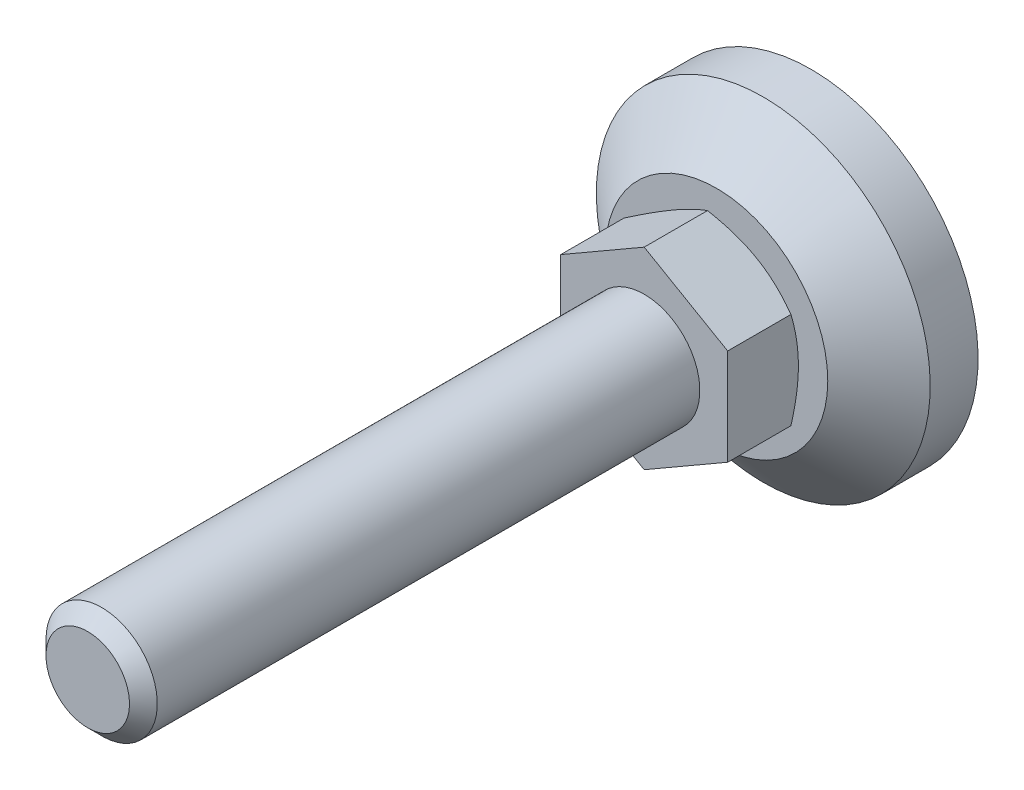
ISO-10303-21;
HEADER;
FILE_DESCRIPTION(('STEP AP214'),'2;1');
FILE_NAME('part.step','',(''),(''),'','','');
FILE_SCHEMA(('AUTOMOTIVE_DESIGN { 1 0 10303 214 1 1 1 1 }'));
ENDSEC;
DATA;
#1=APPLICATION_CONTEXT('core data for automotive mechanical design processes');
#2=APPLICATION_PROTOCOL_DEFINITION('international standard','automotive_design',2000,#1);
#3=PRODUCT_CONTEXT('',#1,'mechanical');
#4=PRODUCT('Part','Part','',(#3));
#5=PRODUCT_RELATED_PRODUCT_CATEGORY('part','',(#4));
#6=PRODUCT_DEFINITION_FORMATION('','',#4);
#7=PRODUCT_DEFINITION_CONTEXT('part definition',#1,'design');
#8=PRODUCT_DEFINITION('design','',#6,#7);
#9=PRODUCT_DEFINITION_SHAPE('','',#8);
#10=(LENGTH_UNIT() NAMED_UNIT(*) SI_UNIT(.MILLI.,.METRE.));
#11=(NAMED_UNIT(*) PLANE_ANGLE_UNIT() SI_UNIT($,.RADIAN.));
#12=(NAMED_UNIT(*) SI_UNIT($,.STERADIAN.) SOLID_ANGLE_UNIT());
#13=UNCERTAINTY_MEASURE_WITH_UNIT(LENGTH_MEASURE(1.E-05),#10,'distance_accuracy_value','');
#14=(GEOMETRIC_REPRESENTATION_CONTEXT(3) GLOBAL_UNCERTAINTY_ASSIGNED_CONTEXT((#13)) GLOBAL_UNIT_ASSIGNED_CONTEXT((#10,
#11,#12)) REPRESENTATION_CONTEXT('',''));
#15=CARTESIAN_POINT('',(0.,0.,0.));
#16=DIRECTION('',(0.,0.,1.));
#17=DIRECTION('',(1.,0.,0.));
#18=AXIS2_PLACEMENT_3D('',#15,#16,#17);
#19=CARTESIAN_POINT('',(0.,0.,30.));
#20=DIRECTION('',(0.,0.,1.));
#21=DIRECTION('',(0.5,-0.86602540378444,0.));
#22=AXIS2_PLACEMENT_3D('',#19,#20,#21);
#23=PLANE('',#22);
#24=DIRECTION('',(0.,1.,0.));
#25=VECTOR('',#24,1.);
#26=CARTESIAN_POINT('',(15.,-8.66025403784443,30.));
#27=LINE('',#26,#25);
#28=CARTESIAN_POINT('',(15.,-8.66025403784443,30.));
#29=VERTEX_POINT('',#28);
#30=CARTESIAN_POINT('',(15.,8.66025403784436,30.));
#31=VERTEX_POINT('',#30);
#32=EDGE_CURVE('E197',#29,#31,#27,.T.);
#33=ORIENTED_EDGE('',*,*,#32,.T.);
#34=DIRECTION('',(-0.866025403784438,0.5,0.));
#35=VECTOR('',#34,1.);
#36=CARTESIAN_POINT('',(15.,8.66025403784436,30.));
#37=LINE('',#36,#35);
#38=CARTESIAN_POINT('',(0.,17.3205080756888,30.));
#39=VERTEX_POINT('',#38);
#40=EDGE_CURVE('E320',#31,#39,#37,.T.);
#41=ORIENTED_EDGE('',*,*,#40,.T.);
#42=DIRECTION('',(-0.86602540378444,-0.5,0.));
#43=VECTOR('',#42,1.);
#44=CARTESIAN_POINT('',(0.,17.3205080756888,30.));
#45=LINE('',#44,#43);
#46=CARTESIAN_POINT('',(-15.,8.66025403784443,30.));
#47=VERTEX_POINT('',#46);
#48=EDGE_CURVE('E319',#39,#47,#45,.T.);
#49=ORIENTED_EDGE('',*,*,#48,.T.);
#50=DIRECTION('',(0.,-1.,0.));
#51=VECTOR('',#50,1.);
#52=CARTESIAN_POINT('',(-15.,8.66025403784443,30.));
#53=LINE('',#52,#51);
#54=CARTESIAN_POINT('',(-15.,-8.66025403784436,30.));
#55=VERTEX_POINT('',#54);
#56=EDGE_CURVE('E324',#47,#55,#53,.T.);
#57=ORIENTED_EDGE('',*,*,#56,.T.);
#58=DIRECTION('',(0.866025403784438,-0.5,0.));
#59=VECTOR('',#58,1.);
#60=CARTESIAN_POINT('',(-15.,-8.66025403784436,30.));
#61=LINE('',#60,#59);
#62=CARTESIAN_POINT('',(0.,-17.3205080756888,30.));
#63=VERTEX_POINT('',#62);
#64=EDGE_CURVE('E326',#55,#63,#61,.T.);
#65=ORIENTED_EDGE('',*,*,#64,.T.);
#66=DIRECTION('',(0.86602540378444,0.5,0.));
#67=VECTOR('',#66,1.);
#68=CARTESIAN_POINT('',(0.,-17.3205080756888,30.));
#69=LINE('',#68,#67);
#70=EDGE_CURVE('E37',#63,#29,#69,.T.);
#71=ORIENTED_EDGE('',*,*,#70,.T.);
#72=EDGE_LOOP('',(#33,#41,#49,#57,#65,#71));
#73=FACE_BOUND('',#72,.T.);
#74=CARTESIAN_POINT('',(0.,0.,30.));
#75=DIRECTION('',(0.,0.,1.));
#76=DIRECTION('',(0.5,-0.86602540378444,0.));
#77=AXIS2_PLACEMENT_3D('',#74,#75,#76);
#78=CIRCLE('',#77,10.);
#79=CARTESIAN_POINT('',(5.,-8.6602540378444,30.));
#80=VERTEX_POINT('',#79);
#81=EDGE_CURVE('E201',#80,#80,#78,.T.);
#82=ORIENTED_EDGE('',*,*,#81,.F.);
#83=EDGE_LOOP('',(#82));
#84=FACE_BOUND('',#83,.T.);
#85=ADVANCED_FACE('F14',(#73,#84),#23,.T.);
#86=CARTESIAN_POINT('',(-9.9946349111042,17.3112154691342,17.));
#87=DIRECTION('',(0.,0.,1.));
#88=DIRECTION('',(0.5,-0.86602540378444,0.));
#89=AXIS2_PLACEMENT_3D('',#86,#87,#88);
#90=PLANE('',#89);
#91=CARTESIAN_POINT('',(0.,0.,17.));
#92=DIRECTION('',(0.,0.,-1.));
#93=DIRECTION('',(-0.5,0.86602540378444,0.));
#94=AXIS2_PLACEMENT_3D('',#91,#92,#93);
#95=CIRCLE('',#94,19.9892698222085);
#96=CARTESIAN_POINT('',(-9.99463491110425,17.3112154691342,17.));
#97=VERTEX_POINT('',#96);
#98=EDGE_CURVE('E102',#97,#97,#95,.T.);
#99=ORIENTED_EDGE('',*,*,#98,.F.);
#100=EDGE_LOOP('',(#99));
#101=FACE_BOUND('',#100,.T.);
#102=CARTESIAN_POINT('',(0.,0.,17.));
#103=DIRECTION('',(0.,0.,-1.));
#104=DIRECTION('',(-0.5,0.86602540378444,0.));
#105=AXIS2_PLACEMENT_3D('',#102,#103,#104);
#106=CIRCLE('',#105,14.5);
#107=CARTESIAN_POINT('',(-7.25,12.5573683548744,17.));
#108=VERTEX_POINT('',#107);
#109=EDGE_CURVE('E84',#108,#108,#106,.T.);
#110=ORIENTED_EDGE('',*,*,#109,.T.);
#111=EDGE_LOOP('',(#110));
#112=FACE_BOUND('',#111,.T.);
#113=ADVANCED_FACE('F174',(#101,#112),#90,.T.);
#114=CARTESIAN_POINT('',(0.,0.,0.));
#115=DIRECTION('',(0.,0.,-1.));
#116=DIRECTION('',(-0.5,0.86602540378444,0.));
#117=AXIS2_PLACEMENT_3D('',#114,#115,#116);
#118=PLANE('',#117);
#119=CARTESIAN_POINT('',(0.,0.,0.));
#120=DIRECTION('',(0.,0.,-1.));
#121=DIRECTION('',(-0.5,0.86602540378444,0.));
#122=AXIS2_PLACEMENT_3D('',#119,#120,#121);
#123=CIRCLE('',#122,30.);
#124=CARTESIAN_POINT('',(-15.,25.9807621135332,0.));
#125=VERTEX_POINT('',#124);
#126=EDGE_CURVE('E73',#125,#125,#123,.T.);
#127=ORIENTED_EDGE('',*,*,#126,.T.);
#128=EDGE_LOOP('',(#127));
#129=FACE_BOUND('',#128,.T.);
#130=ADVANCED_FACE('F177',(#129),#118,.T.);
#131=CARTESIAN_POINT('',(0.,0.,-75.4972525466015));
#132=DIRECTION('',(0.,0.,-1.));
#133=DIRECTION('',(-0.5,0.86602540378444,0.));
#134=AXIS2_PLACEMENT_3D('',#131,#132,#133);
#135=CYLINDRICAL_SURFACE('',#134,30.);
#136=CARTESIAN_POINT('',(0.,0.,8.6));
#137=DIRECTION('',(0.,0.,-1.));
#138=DIRECTION('',(-0.5,0.86602540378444,0.));
#139=AXIS2_PLACEMENT_3D('',#136,#137,#138);
#140=CIRCLE('',#139,30.);
#141=CARTESIAN_POINT('',(-15.,25.9807621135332,8.6));
#142=VERTEX_POINT('',#141);
#143=EDGE_CURVE('E105',#142,#142,#140,.T.);
#144=ORIENTED_EDGE('',*,*,#143,.T.);
#145=EDGE_LOOP('',(#144));
#146=FACE_BOUND('',#145,.T.);
#147=ORIENTED_EDGE('',*,*,#126,.F.);
#148=EDGE_LOOP('',(#147));
#149=FACE_BOUND('',#148,.T.);
#150=ADVANCED_FACE('F181',(#146,#149),#135,.T.);
#151=CARTESIAN_POINT('',(0.,0.,8.6));
#152=DIRECTION('',(0.,0.,-1.));
#153=DIRECTION('',(-0.5,0.86602540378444,0.));
#154=AXIS2_PLACEMENT_3D('',#151,#152,#153);
#155=CONICAL_SURFACE('',#154,30.,0.872664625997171);
#156=ORIENTED_EDGE('',*,*,#98,.T.);
#157=EDGE_LOOP('',(#156));
#158=FACE_BOUND('',#157,.T.);
#159=ORIENTED_EDGE('',*,*,#143,.F.);
#160=EDGE_LOOP('',(#159));
#161=FACE_BOUND('',#160,.T.);
#162=ADVANCED_FACE('F121',(#158,#161),#155,.T.);
#163=CARTESIAN_POINT('',(0.,0.,22.6717337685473));
#164=DIRECTION('',(0.,0.,1.));
#165=DIRECTION('',(0.5,-0.86602540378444,0.));
#166=AXIS2_PLACEMENT_3D('',#163,#164,#165);
#167=CONICAL_SURFACE('',#166,24.3237310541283,1.0471975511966);
#168=ORIENTED_EDGE('',*,*,#109,.F.);
#169=EDGE_LOOP('',(#168));
#170=FACE_BOUND('',#169,.T.);
#171=CARTESIAN_POINT('',(-12.8456594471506,-24.7369530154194,24.7211504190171));
#172=CARTESIAN_POINT('',(-12.5611280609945,-24.5726787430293,24.5612751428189));
#173=CARTESIAN_POINT('',(-12.2762681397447,-24.4082147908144,24.4021798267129));
#174=CARTESIAN_POINT('',(-11.7058227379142,-24.0788679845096,24.0857253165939));
#175=CARTESIAN_POINT('',(-11.4202372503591,-23.913985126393,23.9283661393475));
#176=CARTESIAN_POINT('',(-10.5622163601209,-23.4186065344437,23.4591171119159));
#177=CARTESIAN_POINT('',(-9.98859766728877,-23.0874276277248,23.1501014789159));
#178=CARTESIAN_POINT('',(-8.83456075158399,-22.4211441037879,22.5399454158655));
#179=CARTESIAN_POINT('',(-8.25412262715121,-22.0860279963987,22.2388550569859));
#180=CARTESIAN_POINT('',(-7.08869976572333,-21.4131707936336,21.6486868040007));
#181=CARTESIAN_POINT('',(-6.50371523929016,-21.0754298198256,21.3596083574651));
#182=CARTESIAN_POINT('',(-5.30863673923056,-20.3854509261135,20.7872320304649));
#183=CARTESIAN_POINT('',(-4.69835665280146,-20.0331055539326,20.5044496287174));
#184=CARTESIAN_POINT('',(-3.47072651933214,-19.3243329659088,19.9597325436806));
#185=CARTESIAN_POINT('',(-2.85337569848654,-18.9679053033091,19.6978001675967));
#186=CARTESIAN_POINT('',(-1.61173392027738,-18.251043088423,19.2014950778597));
#187=CARTESIAN_POINT('',(-0.987459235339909,-17.8906179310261,18.9670685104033));
#188=CARTESIAN_POINT('',(0.270101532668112,-17.1645648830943,18.533130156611));
#189=CARTESIAN_POINT('',(0.903384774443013,-16.7989386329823,18.3336076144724));
#190=CARTESIAN_POINT('',(1.85843143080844,-16.2475421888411,18.0681549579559));
#191=CARTESIAN_POINT('',(2.17672728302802,-16.0637739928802,17.9854955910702));
#192=CARTESIAN_POINT('',(2.8155301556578,-15.6949609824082,17.8324159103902));
#193=CARTESIAN_POINT('',(3.13603713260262,-15.509916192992,17.761995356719));
#194=CARTESIAN_POINT('',(3.77905622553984,-15.1386689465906,17.6346216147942));
#195=CARTESIAN_POINT('',(4.1015683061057,-14.952466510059,17.5776681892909));
#196=CARTESIAN_POINT('',(4.7482706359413,-14.5790927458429,17.4783560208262));
#197=CARTESIAN_POINT('',(5.07246081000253,-14.39192146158,17.4359966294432));
#198=CARTESIAN_POINT('',(5.7177482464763,-14.0193645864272,17.3672579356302));
#199=CARTESIAN_POINT('',(6.03882895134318,-13.8339885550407,17.3406726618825));
#200=CARTESIAN_POINT('',(6.68167638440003,-13.4628404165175,17.3032157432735));
#201=CARTESIAN_POINT('',(7.0034431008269,-13.2770683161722,17.2923438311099));
#202=CARTESIAN_POINT('',(7.64708696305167,-12.9054603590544,17.2865732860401));
#203=CARTESIAN_POINT('',(7.96896410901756,-12.719624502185,17.291674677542));
#204=CARTESIAN_POINT('',(8.6122410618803,-12.3482283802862,17.31772364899));
#205=CARTESIAN_POINT('',(8.93364084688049,-12.1626681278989,17.3386719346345));
#206=CARTESIAN_POINT('',(9.70006843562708,-11.7201709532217,17.4070708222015));
#207=CARTESIAN_POINT('',(10.1446275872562,-11.4635046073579,17.4616548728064));
#208=CARTESIAN_POINT('',(11.0305797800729,-10.9519998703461,17.598223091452));
#209=CARTESIAN_POINT('',(11.4719724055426,-10.6971617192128,17.6802107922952));
#210=CARTESIAN_POINT('',(12.3511241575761,-10.1895832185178,17.8686701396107));
#211=CARTESIAN_POINT('',(12.7888803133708,-9.93684458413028,17.9751600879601));
#212=CARTESIAN_POINT('',(13.6600677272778,-9.43386429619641,18.2093621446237));
#213=CARTESIAN_POINT('',(14.093499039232,-9.18362261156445,18.3370739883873));
#214=CARTESIAN_POINT('',(14.9657613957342,-8.68002170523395,18.6136784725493));
#215=CARTESIAN_POINT('',(15.4044935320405,-8.42671958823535,18.7629840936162));
#216=CARTESIAN_POINT('',(16.2776387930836,-7.92260893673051,19.0774927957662));
#217=CARTESIAN_POINT('',(16.7120518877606,-7.67180041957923,19.2426959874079));
#218=CARTESIAN_POINT('',(17.5767675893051,-7.17255657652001,19.5863356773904));
#219=CARTESIAN_POINT('',(18.0070714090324,-6.92412055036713,19.7647681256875));
#220=CARTESIAN_POINT('',(18.8640855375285,-6.42932321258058,20.1327209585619));
#221=CARTESIAN_POINT('',(19.2907959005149,-6.18296186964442,20.3222411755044));
#222=CARTESIAN_POINT('',(20.3428317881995,-5.57556866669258,20.8026992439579));
#223=CARTESIAN_POINT('',(20.9662920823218,-5.21561369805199,21.0990762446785));
#224=CARTESIAN_POINT('',(22.2075096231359,-4.49899641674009,21.7073961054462));
#225=CARTESIAN_POINT('',(22.8252664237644,-4.14233436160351,22.0193401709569));
#226=CARTESIAN_POINT('',(24.0562171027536,-3.43164465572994,22.6554928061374));
#227=CARTESIAN_POINT('',(24.6694096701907,-3.07761776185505,22.9797047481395));
#228=CARTESIAN_POINT('',(25.8918722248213,-2.37182867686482,23.6377669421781));
#229=CARTESIAN_POINT('',(26.5011423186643,-2.02006642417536,23.9716169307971));
#230=CARTESIAN_POINT('',(27.717227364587,-1.31795939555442,24.6474851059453));
#231=CARTESIAN_POINT('',(28.3240381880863,-0.967617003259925,24.9895131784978));
#232=CARTESIAN_POINT('',(29.5349682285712,-0.268486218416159,25.6798644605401));
#233=CARTESIAN_POINT('',(30.1390874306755,0.0803021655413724,26.0281877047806));
#234=CARTESIAN_POINT('',(31.3449758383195,0.776522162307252,26.7299417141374));
#235=CARTESIAN_POINT('',(31.9467453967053,1.12395397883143,27.0833716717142));
#236=CARTESIAN_POINT('',(33.1483798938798,1.81771797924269,27.7945141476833));
#237=CARTESIAN_POINT('',(33.7482448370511,2.16405016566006,28.1522266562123));
#238=CARTESIAN_POINT('',(35.4362393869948,3.13861427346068,29.1651922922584));
#239=CARTESIAN_POINT('',(36.5225182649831,3.76577767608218,29.8245570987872));
#240=CARTESIAN_POINT('',(38.6911220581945,5.01782165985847,31.1520110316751));
#241=CARTESIAN_POINT('',(39.7734467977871,5.64270213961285,31.8201005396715));
#242=CARTESIAN_POINT('',(41.9319563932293,6.88891823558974,33.1609996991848));
#243=CARTESIAN_POINT('',(43.0081499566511,7.51025887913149,33.8337906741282));
#244=CARTESIAN_POINT('',(44.620597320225,8.441205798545,34.8467910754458));
#245=CARTESIAN_POINT('',(45.1577559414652,8.75133447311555,35.1850829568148));
#246=CARTESIAN_POINT('',(46.2315316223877,9.37127915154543,35.8628086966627));
#247=CARTESIAN_POINT('',(46.7681486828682,9.68109515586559,36.2022425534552));
#248=CARTESIAN_POINT('',(47.3045265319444,9.99077305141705,36.5421798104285));
#249=B_SPLINE_CURVE_WITH_KNOTS('',3,(#171,#172,#173,#174,#175,#176,#177,#178,#179,#180,#181,
#182,#183,#184,#185,#186,#187,#188,#189,#190,#191,#192,#193,#194,#195,#196,#197,#198,#199,#200,
#201,#202,#203,#204,#205,#206,#207,#208,#209,#210,#211,#212,#213,#214,#215,#216,#217,#218,#219,
#220,#221,#222,#223,#224,#225,#226,#227,#228,#229,#230,#231,#232,#233,#234,#235,#236,#237,#238,
#239,#240,#241,#242,#243,#244,#245,#246,#247,#248),.UNSPECIFIED.,.F.,.F.,(4,2,2,2,2,2,2,2,2,2,2,
2,2,2,2,2,2,2,2,2,2,2,2,2,2,2,2,2,2,2,2,2,2,2,2,2,2,2,4),(0.,1.09614509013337,2.19230075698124,
4.38492481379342,6.5891013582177,8.79317641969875,11.0708608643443,13.3487970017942,
15.622195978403,17.894893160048,19.0248728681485,20.1548304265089,21.2847680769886,
22.4146555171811,23.5294447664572,24.6442150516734,25.7589870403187,26.8738086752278,
28.4216372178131,29.9696653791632,31.5188536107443,33.0680225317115,34.6521549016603,
36.236298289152,37.8199586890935,39.4035951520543,41.7389293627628,44.0744446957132,
46.4106067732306,48.7467050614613,51.0857864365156,53.4248807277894,55.7636090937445,
58.1023320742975,62.3535003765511,66.6048552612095,70.8441948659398,72.9637328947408,
75.083267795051),.UNSPECIFIED.);
#250=CARTESIAN_POINT('',(0.,-17.3205080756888,18.6284210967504));
#251=VERTEX_POINT('',#250);
#252=CARTESIAN_POINT('',(15.,-8.66025403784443,18.6284210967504));
#253=VERTEX_POINT('',#252);
#254=EDGE_CURVE('E65',#251,#253,#249,.T.);
#255=ORIENTED_EDGE('',*,*,#254,.F.);
#256=CARTESIAN_POINT('',(-15.0002,-8.66013856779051,18.6284877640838));
#257=CARTESIAN_POINT('',(-14.6705058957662,-8.85048754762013,18.5185969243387));
#258=CARTESIAN_POINT('',(-14.3395258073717,-9.0415789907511,18.4136927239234));
#259=CARTESIAN_POINT('',(-13.674911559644,-9.42529420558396,18.2152437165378));
#260=CARTESIAN_POINT('',(-13.3412765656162,-9.61791845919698,18.1217026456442));
#261=CARTESIAN_POINT('',(-12.6707077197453,-10.0050715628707,17.9472372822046));
#262=CARTESIAN_POINT('',(-12.333767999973,-10.1996038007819,17.8663428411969));
#263=CARTESIAN_POINT('',(-11.6575472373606,-10.5900200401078,17.7189077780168));
#264=CARTESIAN_POINT('',(-11.3182663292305,-10.7859039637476,17.6523663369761));
#265=CARTESIAN_POINT('',(-10.6460568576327,-11.1740042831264,17.5364675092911));
#266=CARTESIAN_POINT('',(-10.3131781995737,-11.3661918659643,17.4867265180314));
#267=CARTESIAN_POINT('',(-9.64589556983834,-11.7514476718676,17.4033218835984));
#268=CARTESIAN_POINT('',(-9.31149156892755,-11.9445159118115,17.3696585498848));
#269=CARTESIAN_POINT('',(-8.64212181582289,-12.3309767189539,17.3192592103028));
#270=CARTESIAN_POINT('',(-8.30715720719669,-12.5243686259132,17.3025030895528));
#271=CARTESIAN_POINT('',(-7.63691878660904,-12.9113309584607,17.2862785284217));
#272=CARTESIAN_POINT('',(-7.30164498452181,-13.104901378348,17.2868095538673));
#273=CARTESIAN_POINT('',(-6.67485311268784,-13.4667798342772,17.303951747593));
#274=CARTESIAN_POINT('',(-6.38329037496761,-13.6351136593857,17.3184719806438));
#275=CARTESIAN_POINT('',(-5.80083556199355,-13.971394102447,17.3603122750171));
#276=CARTESIAN_POINT('',(-5.50994353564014,-14.1393406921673,17.3876332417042));
#277=CARTESIAN_POINT('',(-4.9289881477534,-14.4747554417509,17.4545986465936));
#278=CARTESIAN_POINT('',(-4.63892567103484,-14.6422230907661,17.4942532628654));
#279=CARTESIAN_POINT('',(-4.06016058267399,-14.9763732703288,17.5851902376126));
#280=CARTESIAN_POINT('',(-3.77145806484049,-15.1430557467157,17.636473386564));
#281=CARTESIAN_POINT('',(-2.89508556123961,-15.6490296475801,17.8090619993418));
#282=CARTESIAN_POINT('',(-2.30995340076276,-15.9868558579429,17.9475763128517));
#283=CARTESIAN_POINT('',(-1.14841408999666,-16.657470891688,18.26194710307));
#284=CARTESIAN_POINT('',(-0.571992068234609,-16.9902683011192,18.4377297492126));
#285=CARTESIAN_POINT('',(0.000199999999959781,-17.3206235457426,18.6284877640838));
#286=B_SPLINE_CURVE_WITH_KNOTS('',3,(#256,#257,#258,#259,#260,#261,#262,#263,#264,#265,#266,
#267,#268,#269,#270,#271,#272,#273,#274,#275,#276,#277,#278,#279,#280,#281,#282,#283,#284,#285),
.UNSPECIFIED.,.F.,.F.,(4,2,2,2,2,2,2,2,2,2,2,2,2,2,4),(0.,1.18875411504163,2.37789802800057,
3.56980778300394,4.76164951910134,5.92407379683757,7.08652044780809,8.24758247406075,
9.40860862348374,10.4193068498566,11.4300765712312,12.4416826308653,13.4533574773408,
15.5211962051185,17.5849760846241),.UNSPECIFIED.);
#287=CARTESIAN_POINT('',(-15.,-8.66025403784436,18.6284210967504));
#288=VERTEX_POINT('',#287);
#289=EDGE_CURVE('E68',#288,#251,#286,.T.);
#290=ORIENTED_EDGE('',*,*,#289,.F.);
#291=CARTESIAN_POINT('',(-15.,8.66048497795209,18.6284877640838));
#292=CARTESIAN_POINT('',(-15.,8.27978701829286,18.5185969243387));
#293=CARTESIAN_POINT('',(-15.,7.89760413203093,18.4136927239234));
#294=CARTESIAN_POINT('',(-15.,7.13017370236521,18.2152437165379));
#295=CARTESIAN_POINT('',(-15.,6.74492519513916,18.1217026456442));
#296=CARTESIAN_POINT('',(-15.,5.97061898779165,17.9472372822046));
#297=CARTESIAN_POINT('',(-15.,5.58155451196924,17.8663428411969));
#298=CARTESIAN_POINT('',(-15.,4.80072203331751,17.7189077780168));
#299=CARTESIAN_POINT('',(-15.,4.40895418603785,17.6523663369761));
#300=CARTESIAN_POINT('',(-15.,3.63275354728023,17.5364675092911));
#301=CARTESIAN_POINT('',(-15.,3.24837838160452,17.4867265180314));
#302=CARTESIAN_POINT('',(-15.,2.47786676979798,17.4033218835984));
#303=CARTESIAN_POINT('',(-15.,2.0917302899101,17.3696585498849));
#304=CARTESIAN_POINT('',(-15.,1.31880867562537,17.3192592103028));
#305=CARTESIAN_POINT('',(-15.,0.932024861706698,17.3025030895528));
#306=CARTESIAN_POINT('',(-15.,0.158100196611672,17.2862785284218));
#307=CARTESIAN_POINT('',(-15.,-0.229040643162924,17.2868095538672));
#308=CARTESIAN_POINT('',(-15.,-0.952797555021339,17.303951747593));
#309=CARTESIAN_POINT('',(-15.,-1.28946520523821,17.3184719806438));
#310=CARTESIAN_POINT('',(-15.,-1.96202609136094,17.3603122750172));
#311=CARTESIAN_POINT('',(-15.,-2.29791927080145,17.3876332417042));
#312=CARTESIAN_POINT('',(-15.,-2.96874876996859,17.4545986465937));
#313=CARTESIAN_POINT('',(-15.,-3.30368406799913,17.4942532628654));
#314=CARTESIAN_POINT('',(-15.,-3.97198442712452,17.5851902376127));
#315=CARTESIAN_POINT('',(-15.,-4.3053493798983,17.636473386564));
#316=CARTESIAN_POINT('',(-15.,-5.317297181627,17.8090619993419));
#317=CARTESIAN_POINT('',(-15.,-5.99294960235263,17.9475763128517));
#318=CARTESIAN_POINT('',(-15.,-7.33417966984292,18.26194710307));
#319=CARTESIAN_POINT('',(-15.,-7.99977448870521,18.4377297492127));
#320=CARTESIAN_POINT('',(-15.,-8.66048497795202,18.6284877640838));
#321=B_SPLINE_CURVE_WITH_KNOTS('',3,(#291,#292,#293,#294,#295,#296,#297,#298,#299,#300,#301,
#302,#303,#304,#305,#306,#307,#308,#309,#310,#311,#312,#313,#314,#315,#316,#317,#318,#319,#320),
.UNSPECIFIED.,.F.,.F.,(4,2,2,2,2,2,2,2,2,2,2,2,2,2,4),(0.,1.18875411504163,2.37789802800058,
3.56980778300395,4.76164951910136,5.92407379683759,7.08652044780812,8.24758247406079,
9.40860862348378,10.4193068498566,11.4300765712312,12.4416826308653,13.4533574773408,
15.5211962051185,17.5849760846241),.UNSPECIFIED.);
#322=CARTESIAN_POINT('',(-15.,8.66025403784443,18.6284210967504));
#323=VERTEX_POINT('',#322);
#324=EDGE_CURVE('E83',#323,#288,#321,.T.);
#325=ORIENTED_EDGE('',*,*,#324,.F.);
#326=CARTESIAN_POINT('',(-27.8456594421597,1.24380910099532,24.7211504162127));
#327=CARTESIAN_POINT('',(-27.5611280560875,1.40808337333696,24.561275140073));
#328=CARTESIAN_POINT('',(-27.2762681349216,1.5725473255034,24.4021798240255));
#329=CARTESIAN_POINT('',(-26.7058227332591,1.90189413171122,24.0857253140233));
#330=CARTESIAN_POINT('',(-26.4202372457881,2.06677698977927,23.9283661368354));
#331=CARTESIAN_POINT('',(-25.5622163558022,2.56215558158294,23.4591171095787));
#332=CARTESIAN_POINT('',(-24.9885976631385,2.89333448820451,23.150101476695));
#333=CARTESIAN_POINT('',(-23.8345607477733,3.55961801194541,22.5399454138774));
#334=CARTESIAN_POINT('',(-23.2541226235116,3.89473411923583,22.2388550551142));
#335=CARTESIAN_POINT('',(-22.088699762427,4.56759132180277,21.64868680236));
#336=CARTESIAN_POINT('',(-21.503715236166,4.9053322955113,21.3596083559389));
#337=CARTESIAN_POINT('',(-20.3086367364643,5.59531118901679,20.787232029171));
#338=CARTESIAN_POINT('',(-19.698356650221,5.94765656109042,20.5044496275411));
#339=CARTESIAN_POINT('',(-18.4707265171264,6.65642914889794,19.9597325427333));
#340=CARTESIAN_POINT('',(-17.8533756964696,7.01285681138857,19.6978001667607));
#341=CARTESIAN_POINT('',(-16.6117339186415,7.72971902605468,19.2014950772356));
#342=CARTESIAN_POINT('',(-15.9874592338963,8.09014418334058,18.96706850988));
#343=CARTESIAN_POINT('',(-14.7298984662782,8.81619723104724,18.5331301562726));
#344=CARTESIAN_POINT('',(-14.0966152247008,9.1818234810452,18.3336076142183));
#345=CARTESIAN_POINT('',(-13.1415685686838,9.73321992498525,18.0681549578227));
#346=CARTESIAN_POINT('',(-12.8232727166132,9.91698812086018,17.9854955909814));
#347=CARTESIAN_POINT('',(-12.1844698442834,10.2858011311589,17.8324159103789));
#348=CARTESIAN_POINT('',(-11.8639628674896,10.4708459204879,17.7619953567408));
#349=CARTESIAN_POINT('',(-11.2209437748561,10.8420931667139,17.6346216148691));
#350=CARTESIAN_POINT('',(-10.898431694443,11.0282956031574,17.5776681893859));
#351=CARTESIAN_POINT('',(-10.2517293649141,11.4016693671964,17.4783560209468));
#352=CARTESIAN_POINT('',(-9.92753919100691,11.5888406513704,17.4359966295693));
#353=CARTESIAN_POINT('',(-9.28225175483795,11.9613975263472,17.3672579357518));
#354=CARTESIAN_POINT('',(-8.96117105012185,12.1467735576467,17.3406726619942));
#355=CARTESIAN_POINT('',(-8.31832361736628,12.5179216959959,17.30321574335));
#356=CARTESIAN_POINT('',(-7.9965569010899,12.7036937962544,17.2923438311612));
#357=CARTESIAN_POINT('',(-7.352913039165,13.075301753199,17.2865732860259));
#358=CARTESIAN_POINT('',(-7.03103589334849,13.2611376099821,17.2916746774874));
#359=CARTESIAN_POINT('',(-6.38775894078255,13.6325337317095,17.3177236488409));
#360=CARTESIAN_POINT('',(-6.06635915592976,13.8180939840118,17.3386719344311));
#361=CARTESIAN_POINT('',(-5.29993156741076,14.2605911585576,17.4070708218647));
#362=CARTESIAN_POINT('',(-4.85537241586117,14.5172575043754,17.4616548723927));
#363=CARTESIAN_POINT('',(-3.96942022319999,15.0287622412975,17.5982230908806));
#364=CARTESIAN_POINT('',(-3.52802759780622,15.2836003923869,17.6802107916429));
#365=CARTESIAN_POINT('',(-2.64887584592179,15.7911788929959,17.8686701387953));
#366=CARTESIAN_POINT('',(-2.21111969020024,16.0439175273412,17.9751600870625));
#367=CARTESIAN_POINT('',(-1.33993227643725,16.5468978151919,18.2093621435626));
#368=CARTESIAN_POINT('',(-0.906500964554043,16.7971394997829,18.3370739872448));
#369=CARTESIAN_POINT('',(-0.0342386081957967,17.3007404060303,18.6136784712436));
#370=CARTESIAN_POINT('',(0.404493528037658,17.5540425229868,18.7629840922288));
#371=CARTESIAN_POINT('',(1.27763878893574,18.0581531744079,19.0774927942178));
#372=CARTESIAN_POINT('',(1.71205188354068,18.3089616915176,19.2426959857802));
#373=CARTESIAN_POINT('',(2.57676758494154,18.8082055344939,19.586335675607));
#374=CARTESIAN_POINT('',(3.00707140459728,19.0566415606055,19.7647681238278));
#375=CARTESIAN_POINT('',(3.86408553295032,19.5514388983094,20.1327209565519));
#376=CARTESIAN_POINT('',(4.29079589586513,19.7978002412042,20.3222411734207));
#377=CARTESIAN_POINT('',(5.34283178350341,20.4051934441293,20.8026992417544));
#378=CARTESIAN_POINT('',(5.9662920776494,20.7651484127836,21.0990762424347));
#379=CARTESIAN_POINT('',(7.20750961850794,21.4817656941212,21.707396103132));
#380=CARTESIAN_POINT('',(7.82526641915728,21.8384277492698,22.0193401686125));
#381=CARTESIAN_POINT('',(9.05621709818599,22.5491174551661,22.6554928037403));
#382=CARTESIAN_POINT('',(9.66940966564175,22.9031443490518,22.97970474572));
#383=CARTESIAN_POINT('',(10.8918722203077,23.6089334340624,23.6377669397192));
#384=CARTESIAN_POINT('',(11.5011423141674,23.9606956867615,23.9716169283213));
#385=CARTESIAN_POINT('',(12.7172273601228,24.6628027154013,24.6474851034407));
#386=CARTESIAN_POINT('',(13.3240381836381,25.0131451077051,24.9895131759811));
#387=CARTESIAN_POINT('',(14.5349682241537,25.7122758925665,25.6798644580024));
#388=CARTESIAN_POINT('',(15.1390874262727,26.0610642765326,26.0281877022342));
#389=CARTESIAN_POINT('',(16.3449758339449,26.7572842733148,26.7299417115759));
#390=CARTESIAN_POINT('',(16.9467453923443,27.1047160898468,27.0833716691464));
#391=CARTESIAN_POINT('',(18.1483798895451,27.7984800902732,27.7945141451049));
#392=CARTESIAN_POINT('',(18.7482448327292,28.144812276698,28.1522266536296));
#393=CARTESIAN_POINT('',(20.4362393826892,29.119376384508,29.1651922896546));
#394=CARTESIAN_POINT('',(21.5225182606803,29.7465397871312,29.8245570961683));
#395=CARTESIAN_POINT('',(23.6911220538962,30.99858377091,31.1520110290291));
#396=CARTESIAN_POINT('',(24.7734467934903,31.6234642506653,31.8201005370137));
#397=CARTESIAN_POINT('',(26.9319563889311,32.8696803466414,33.1609996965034));
#398=CARTESIAN_POINT('',(28.0081499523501,33.4910209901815,33.833790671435));
#399=CARTESIAN_POINT('',(29.6205973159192,34.4219679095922,34.8467910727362));
#400=CARTESIAN_POINT('',(30.1577559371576,34.7320965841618,35.1850829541));
#401=CARTESIAN_POINT('',(31.2315316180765,35.3520412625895,35.8628086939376));
#402=CARTESIAN_POINT('',(31.7681486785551,35.6618572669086,36.2022425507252));
#403=CARTESIAN_POINT('',(32.3045265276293,35.9715351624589,36.5421798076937));
#404=B_SPLINE_CURVE_WITH_KNOTS('',3,(#326,#327,#328,#329,#330,#331,#332,#333,#334,#335,#336,
#337,#338,#339,#340,#341,#342,#343,#344,#345,#346,#347,#348,#349,#350,#351,#352,#353,#354,#355,
#356,#357,#358,#359,#360,#361,#362,#363,#364,#365,#366,#367,#368,#369,#370,#371,#372,#373,#374,
#375,#376,#377,#378,#379,#380,#381,#382,#383,#384,#385,#386,#387,#388,#389,#390,#391,#392,#393,
#394,#395,#396,#397,#398,#399,#400,#401,#402,#403),.UNSPECIFIED.,.F.,.F.,(4,2,2,2,2,2,2,2,2,2,2,
2,2,2,2,2,2,2,2,2,2,2,2,2,2,2,2,2,2,2,2,2,2,2,2,2,2,2,4),(0.,1.09614508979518,2.19230075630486,
4.38492481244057,6.5891013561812,8.79317641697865,11.0708608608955,13.3487969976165,
15.6221959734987,17.8948931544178,19.024872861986,20.1548304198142,21.2847680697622,
22.4146555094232,23.5294447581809,24.6442150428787,25.7589870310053,26.8738086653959,
28.421637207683,29.9696653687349,31.5188536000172,33.0680225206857,34.6521548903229,
36.2362982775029,37.8199586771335,39.4035951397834,41.7389293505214,44.0744446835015,
46.4106067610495,48.7467050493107,51.0857864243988,53.4248807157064,55.7636090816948,
58.1023320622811,62.3535003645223,66.6048552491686,70.8441948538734,72.9637328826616,
75.0832677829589),.UNSPECIFIED.);
#405=CARTESIAN_POINT('',(0.,17.3205080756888,18.6284210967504));
#406=VERTEX_POINT('',#405);
#407=EDGE_CURVE('E143',#406,#323,#404,.F.);
#408=ORIENTED_EDGE('',*,*,#407,.F.);
#409=CARTESIAN_POINT('',(15.0002,8.66013856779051,18.6284877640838));
#410=CARTESIAN_POINT('',(14.6705058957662,8.85048754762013,18.5185969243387));
#411=CARTESIAN_POINT('',(14.3395258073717,9.0415789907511,18.4136927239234));
#412=CARTESIAN_POINT('',(13.674911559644,9.42529420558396,18.2152437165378));
#413=CARTESIAN_POINT('',(13.3412765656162,9.61791845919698,18.1217026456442));
#414=CARTESIAN_POINT('',(12.6707077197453,10.0050715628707,17.9472372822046));
#415=CARTESIAN_POINT('',(12.333767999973,10.1996038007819,17.8663428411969));
#416=CARTESIAN_POINT('',(11.6575472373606,10.5900200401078,17.7189077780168));
#417=CARTESIAN_POINT('',(11.3182663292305,10.7859039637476,17.6523663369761));
#418=CARTESIAN_POINT('',(10.6460568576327,11.1740042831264,17.5364675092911));
#419=CARTESIAN_POINT('',(10.3131781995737,11.3661918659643,17.4867265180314));
#420=CARTESIAN_POINT('',(9.64589556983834,11.7514476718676,17.4033218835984));
#421=CARTESIAN_POINT('',(9.31149156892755,11.9445159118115,17.3696585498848));
#422=CARTESIAN_POINT('',(8.64212181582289,12.3309767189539,17.3192592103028));
#423=CARTESIAN_POINT('',(8.30715720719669,12.5243686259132,17.3025030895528));
#424=CARTESIAN_POINT('',(7.63691878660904,12.9113309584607,17.2862785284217));
#425=CARTESIAN_POINT('',(7.30164498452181,13.104901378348,17.2868095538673));
#426=CARTESIAN_POINT('',(6.67485311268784,13.4667798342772,17.303951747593));
#427=CARTESIAN_POINT('',(6.38329037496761,13.6351136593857,17.3184719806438));
#428=CARTESIAN_POINT('',(5.80083556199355,13.971394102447,17.3603122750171));
#429=CARTESIAN_POINT('',(5.50994353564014,14.1393406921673,17.3876332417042));
#430=CARTESIAN_POINT('',(4.9289881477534,14.4747554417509,17.4545986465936));
#431=CARTESIAN_POINT('',(4.63892567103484,14.6422230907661,17.4942532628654));
#432=CARTESIAN_POINT('',(4.06016058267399,14.9763732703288,17.5851902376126));
#433=CARTESIAN_POINT('',(3.77145806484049,15.1430557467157,17.636473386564));
#434=CARTESIAN_POINT('',(2.89508556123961,15.6490296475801,17.8090619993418));
#435=CARTESIAN_POINT('',(2.30995340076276,15.9868558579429,17.9475763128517));
#436=CARTESIAN_POINT('',(1.14841408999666,16.657470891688,18.26194710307));
#437=CARTESIAN_POINT('',(0.571992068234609,16.9902683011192,18.4377297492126));
#438=CARTESIAN_POINT('',(-0.000199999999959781,17.3206235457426,18.6284877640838));
#439=B_SPLINE_CURVE_WITH_KNOTS('',3,(#409,#410,#411,#412,#413,#414,#415,#416,#417,#418,#419,
#420,#421,#422,#423,#424,#425,#426,#427,#428,#429,#430,#431,#432,#433,#434,#435,#436,#437,#438),
.UNSPECIFIED.,.F.,.F.,(4,2,2,2,2,2,2,2,2,2,2,2,2,2,4),(0.,1.18875411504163,2.37789802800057,
3.56980778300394,4.76164951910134,5.92407379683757,7.08652044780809,8.24758247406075,
9.40860862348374,10.4193068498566,11.4300765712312,12.4416826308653,13.4533574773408,
15.5211962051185,17.5849760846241),.UNSPECIFIED.);
#440=CARTESIAN_POINT('',(15.,8.66025403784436,18.6284210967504));
#441=VERTEX_POINT('',#440);
#442=EDGE_CURVE('E150',#441,#406,#439,.T.);
#443=ORIENTED_EDGE('',*,*,#442,.F.);
#444=CARTESIAN_POINT('',(15.,-8.66048497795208,18.6284877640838));
#445=CARTESIAN_POINT('',(15.,-8.27978701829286,18.5185969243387));
#446=CARTESIAN_POINT('',(15.,-7.89760413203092,18.4136927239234));
#447=CARTESIAN_POINT('',(15.,-7.1301737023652,18.2152437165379));
#448=CARTESIAN_POINT('',(15.,-6.74492519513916,18.1217026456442));
#449=CARTESIAN_POINT('',(15.,-5.97061898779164,17.9472372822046));
#450=CARTESIAN_POINT('',(15.,-5.58155451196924,17.8663428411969));
#451=CARTESIAN_POINT('',(15.,-4.8007220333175,17.7189077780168));
#452=CARTESIAN_POINT('',(15.,-4.40895418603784,17.6523663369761));
#453=CARTESIAN_POINT('',(15.,-3.63275354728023,17.5364675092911));
#454=CARTESIAN_POINT('',(15.,-3.24837838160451,17.4867265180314));
#455=CARTESIAN_POINT('',(15.,-2.47786676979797,17.4033218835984));
#456=CARTESIAN_POINT('',(15.,-2.0917302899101,17.3696585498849));
#457=CARTESIAN_POINT('',(15.,-1.31880867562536,17.3192592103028));
#458=CARTESIAN_POINT('',(15.,-0.932024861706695,17.3025030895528));
#459=CARTESIAN_POINT('',(15.,-0.158100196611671,17.2862785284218));
#460=CARTESIAN_POINT('',(15.,0.229040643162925,17.2868095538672));
#461=CARTESIAN_POINT('',(15.,0.952797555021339,17.303951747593));
#462=CARTESIAN_POINT('',(15.,1.28946520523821,17.3184719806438));
#463=CARTESIAN_POINT('',(15.,1.96202609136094,17.3603122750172));
#464=CARTESIAN_POINT('',(15.,2.29791927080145,17.3876332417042));
#465=CARTESIAN_POINT('',(15.,2.96874876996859,17.4545986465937));
#466=CARTESIAN_POINT('',(15.,3.30368406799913,17.4942532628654));
#467=CARTESIAN_POINT('',(15.,3.97198442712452,17.5851902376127));
#468=CARTESIAN_POINT('',(15.,4.3053493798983,17.636473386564));
#469=CARTESIAN_POINT('',(15.,5.317297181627,17.8090619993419));
#470=CARTESIAN_POINT('',(15.,5.99294960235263,17.9475763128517));
#471=CARTESIAN_POINT('',(15.,7.33417966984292,18.26194710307));
#472=CARTESIAN_POINT('',(15.,7.99977448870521,18.4377297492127));
#473=CARTESIAN_POINT('',(15.,8.66048497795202,18.6284877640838));
#474=B_SPLINE_CURVE_WITH_KNOTS('',3,(#444,#445,#446,#447,#448,#449,#450,#451,#452,#453,#454,
#455,#456,#457,#458,#459,#460,#461,#462,#463,#464,#465,#466,#467,#468,#469,#470,#471,#472,#473),
.UNSPECIFIED.,.F.,.F.,(4,2,2,2,2,2,2,2,2,2,2,2,2,2,4),(0.,1.18875411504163,2.37789802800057,
3.56980778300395,4.76164951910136,5.92407379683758,7.08652044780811,8.24758247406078,
9.40860862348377,10.4193068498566,11.4300765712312,12.4416826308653,13.4533574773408,
15.5211962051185,17.5849760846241),.UNSPECIFIED.);
#475=EDGE_CURVE('E29',#253,#441,#474,.T.);
#476=ORIENTED_EDGE('',*,*,#475,.F.);
#477=EDGE_LOOP('',(#255,#290,#325,#408,#443,#476));
#478=FACE_BOUND('',#477,.T.);
#479=ADVANCED_FACE('F67',(#170,#478),#167,.T.);
#480=CARTESIAN_POINT('',(0.,-17.3205080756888,30.));
#481=DIRECTION('',(-0.5,0.86602540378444,0.));
#482=DIRECTION('',(-0.86602540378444,-0.5,0.));
#483=AXIS2_PLACEMENT_3D('',#480,#481,#482);
#484=PLANE('',#483);
#485=DIRECTION('',(0.,0.,-1.));
#486=VECTOR('',#485,1.);
#487=CARTESIAN_POINT('',(0.,-17.3205080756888,30.));
#488=LINE('',#487,#486);
#489=EDGE_CURVE('E80',#63,#251,#488,.T.);
#490=ORIENTED_EDGE('',*,*,#489,.T.);
#491=ORIENTED_EDGE('',*,*,#254,.T.);
#492=DIRECTION('',(0.,0.,-1.));
#493=VECTOR('',#492,1.);
#494=CARTESIAN_POINT('',(15.,-8.66025403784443,30.));
#495=LINE('',#494,#493);
#496=EDGE_CURVE('E87',#29,#253,#495,.T.);
#497=ORIENTED_EDGE('',*,*,#496,.F.);
#498=ORIENTED_EDGE('',*,*,#70,.F.);
#499=EDGE_LOOP('',(#490,#491,#497,#498));
#500=FACE_BOUND('',#499,.T.);
#501=ADVANCED_FACE('F86',(#500),#484,.F.);
#502=CARTESIAN_POINT('',(-15.,-8.66025403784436,30.));
#503=DIRECTION('',(0.5,0.866025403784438,0.));
#504=DIRECTION('',(-0.866025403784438,0.5,0.));
#505=AXIS2_PLACEMENT_3D('',#502,#503,#504);
#506=PLANE('',#505);
#507=DIRECTION('',(0.,0.,-1.));
#508=VECTOR('',#507,1.);
#509=CARTESIAN_POINT('',(-15.,-8.66025403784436,30.));
#510=LINE('',#509,#508);
#511=EDGE_CURVE('E82',#55,#288,#510,.T.);
#512=ORIENTED_EDGE('',*,*,#511,.T.);
#513=ORIENTED_EDGE('',*,*,#289,.T.);
#514=ORIENTED_EDGE('',*,*,#489,.F.);
#515=ORIENTED_EDGE('',*,*,#64,.F.);
#516=EDGE_LOOP('',(#512,#513,#514,#515));
#517=FACE_BOUND('',#516,.T.);
#518=ADVANCED_FACE('F78',(#517),#506,.F.);
#519=CARTESIAN_POINT('',(-15.,8.66025403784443,30.));
#520=DIRECTION('',(1.,0.,0.));
#521=DIRECTION('',(0.,1.,0.));
#522=AXIS2_PLACEMENT_3D('',#519,#520,#521);
#523=PLANE('',#522);
#524=DIRECTION('',(0.,0.,-1.));
#525=VECTOR('',#524,1.);
#526=CARTESIAN_POINT('',(-15.,8.66025403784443,30.));
#527=LINE('',#526,#525);
#528=EDGE_CURVE('E89',#47,#323,#527,.T.);
#529=ORIENTED_EDGE('',*,*,#528,.T.);
#530=ORIENTED_EDGE('',*,*,#324,.T.);
#531=ORIENTED_EDGE('',*,*,#511,.F.);
#532=ORIENTED_EDGE('',*,*,#56,.F.);
#533=EDGE_LOOP('',(#529,#530,#531,#532));
#534=FACE_BOUND('',#533,.T.);
#535=ADVANCED_FACE('F297',(#534),#523,.F.);
#536=CARTESIAN_POINT('',(0.,17.3205080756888,30.));
#537=DIRECTION('',(0.5,-0.86602540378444,0.));
#538=DIRECTION('',(0.86602540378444,0.5,0.));
#539=AXIS2_PLACEMENT_3D('',#536,#537,#538);
#540=PLANE('',#539);
#541=DIRECTION('',(0.,0.,-1.));
#542=VECTOR('',#541,1.);
#543=CARTESIAN_POINT('',(0.,17.3205080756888,30.));
#544=LINE('',#543,#542);
#545=EDGE_CURVE('E96',#39,#406,#544,.T.);
#546=ORIENTED_EDGE('',*,*,#545,.T.);
#547=ORIENTED_EDGE('',*,*,#407,.T.);
#548=ORIENTED_EDGE('',*,*,#528,.F.);
#549=ORIENTED_EDGE('',*,*,#48,.F.);
#550=EDGE_LOOP('',(#546,#547,#548,#549));
#551=FACE_BOUND('',#550,.T.);
#552=ADVANCED_FACE('F167',(#551),#540,.F.);
#553=CARTESIAN_POINT('',(15.,8.66025403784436,30.));
#554=DIRECTION('',(-0.5,-0.866025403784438,0.));
#555=DIRECTION('',(0.866025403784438,-0.5,0.));
#556=AXIS2_PLACEMENT_3D('',#553,#554,#555);
#557=PLANE('',#556);
#558=DIRECTION('',(0.,0.,-1.));
#559=VECTOR('',#558,1.);
#560=CARTESIAN_POINT('',(15.,8.66025403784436,30.));
#561=LINE('',#560,#559);
#562=EDGE_CURVE('E99',#31,#441,#561,.T.);
#563=ORIENTED_EDGE('',*,*,#562,.T.);
#564=ORIENTED_EDGE('',*,*,#442,.T.);
#565=ORIENTED_EDGE('',*,*,#545,.F.);
#566=ORIENTED_EDGE('',*,*,#40,.F.);
#567=EDGE_LOOP('',(#563,#564,#565,#566));
#568=FACE_BOUND('',#567,.T.);
#569=ADVANCED_FACE('F163',(#568),#557,.F.);
#570=CARTESIAN_POINT('',(15.,-8.66025403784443,30.));
#571=DIRECTION('',(-1.,0.,0.));
#572=DIRECTION('',(0.,-1.,0.));
#573=AXIS2_PLACEMENT_3D('',#570,#571,#572);
#574=PLANE('',#573);
#575=ORIENTED_EDGE('',*,*,#496,.T.);
#576=ORIENTED_EDGE('',*,*,#475,.T.);
#577=ORIENTED_EDGE('',*,*,#562,.F.);
#578=ORIENTED_EDGE('',*,*,#32,.F.);
#579=EDGE_LOOP('',(#575,#576,#577,#578));
#580=FACE_BOUND('',#579,.T.);
#581=ADVANCED_FACE('F166',(#580),#574,.F.);
#582=CARTESIAN_POINT('',(0.,0.,130.));
#583=DIRECTION('',(0.,0.,-1.));
#584=DIRECTION('',(-0.5,0.86602540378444,0.));
#585=AXIS2_PLACEMENT_3D('',#582,#583,#584);
#586=CYLINDRICAL_SURFACE('',#585,10.);
#587=CARTESIAN_POINT('',(0.,0.,127.5));
#588=DIRECTION('',(0.,0.,1.));
#589=DIRECTION('',(0.5,-0.86602540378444,0.));
#590=AXIS2_PLACEMENT_3D('',#587,#588,#589);
#591=CIRCLE('',#590,10.);
#592=CARTESIAN_POINT('',(5.,-8.6602540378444,127.5));
#593=VERTEX_POINT('',#592);
#594=EDGE_CURVE('E9',#593,#593,#591,.F.);
#595=ORIENTED_EDGE('',*,*,#594,.T.);
#596=EDGE_LOOP('',(#595));
#597=FACE_BOUND('',#596,.T.);
#598=ORIENTED_EDGE('',*,*,#81,.T.);
#599=EDGE_LOOP('',(#598));
#600=FACE_BOUND('',#599,.T.);
#601=ADVANCED_FACE('F123',(#597,#600),#586,.T.);
#602=CARTESIAN_POINT('',(0.,0.,130.));
#603=DIRECTION('',(0.,0.,1.));
#604=DIRECTION('',(0.5,-0.86602540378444,0.));
#605=AXIS2_PLACEMENT_3D('',#602,#603,#604);
#606=PLANE('',#605);
#607=CARTESIAN_POINT('',(0.,0.,130.));
#608=DIRECTION('',(0.,0.,1.));
#609=DIRECTION('',(0.5,-0.86602540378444,0.));
#610=AXIS2_PLACEMENT_3D('',#607,#608,#609);
#611=CIRCLE('',#610,7.5);
#612=CARTESIAN_POINT('',(3.75,-6.4951905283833,130.));
#613=VERTEX_POINT('',#612);
#614=EDGE_CURVE('E22',#613,#613,#611,.T.);
#615=ORIENTED_EDGE('',*,*,#614,.T.);
#616=EDGE_LOOP('',(#615));
#617=FACE_BOUND('',#616,.T.);
#618=ADVANCED_FACE('F208',(#617),#606,.T.);
#619=CARTESIAN_POINT('',(0.,0.,130.));
#620=DIRECTION('',(0.,0.,-1.));
#621=DIRECTION('',(-0.5,0.86602540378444,0.));
#622=AXIS2_PLACEMENT_3D('',#619,#620,#621);
#623=CONICAL_SURFACE('',#622,7.5,0.785398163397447);
#624=ORIENTED_EDGE('',*,*,#594,.F.);
#625=EDGE_LOOP('',(#624));
#626=FACE_BOUND('',#625,.T.);
#627=ORIENTED_EDGE('',*,*,#614,.F.);
#628=EDGE_LOOP('',(#627));
#629=FACE_BOUND('',#628,.T.);
#630=ADVANCED_FACE('F16',(#626,#629),#623,.T.);
#631=CLOSED_SHELL('',(#85,#113,#130,#150,#162,#479,#501,#518,#535,#552,#569,#581,#601,#618,#630));
#632=MANIFOLD_SOLID_BREP('B1',#631);
#633=ADVANCED_BREP_SHAPE_REPRESENTATION('',(#18,#632),#14);
#634=SHAPE_DEFINITION_REPRESENTATION(#9,#633);
ENDSEC;
END-ISO-10303-21;
